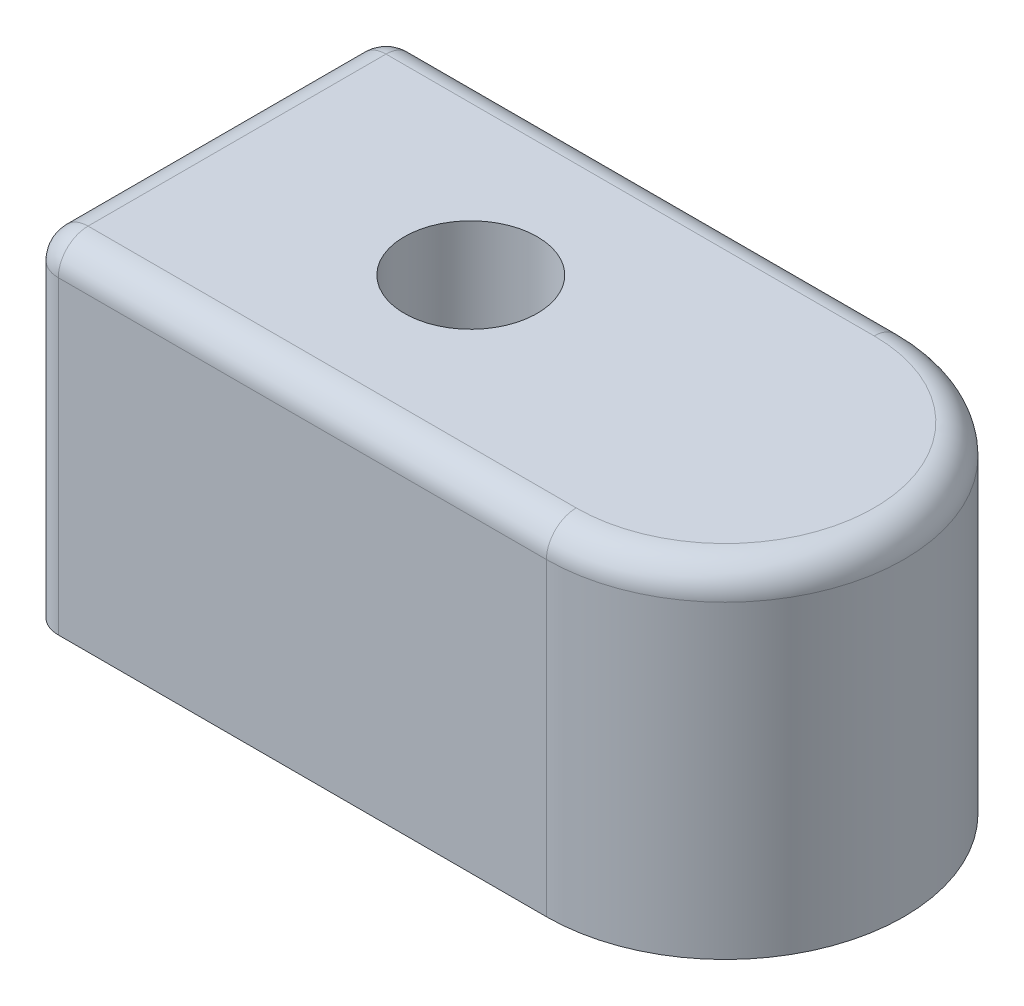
ISO-10303-21;
HEADER;
FILE_DESCRIPTION(('STEP AP214'),'2;1');
FILE_NAME('part.step','',(''),(''),'','','');
FILE_SCHEMA(('AUTOMOTIVE_DESIGN { 1 0 10303 214 1 1 1 1 }'));
ENDSEC;
DATA;
#1=APPLICATION_CONTEXT('core data for automotive mechanical design processes');
#2=APPLICATION_PROTOCOL_DEFINITION('international standard','automotive_design',2000,#1);
#3=PRODUCT_CONTEXT('',#1,'mechanical');
#4=PRODUCT('Part','Part','',(#3));
#5=PRODUCT_RELATED_PRODUCT_CATEGORY('part','',(#4));
#6=PRODUCT_DEFINITION_FORMATION('','',#4);
#7=PRODUCT_DEFINITION_CONTEXT('part definition',#1,'design');
#8=PRODUCT_DEFINITION('design','',#6,#7);
#9=PRODUCT_DEFINITION_SHAPE('','',#8);
#10=(LENGTH_UNIT() NAMED_UNIT(*) SI_UNIT(.MILLI.,.METRE.));
#11=(NAMED_UNIT(*) PLANE_ANGLE_UNIT() SI_UNIT($,.RADIAN.));
#12=(NAMED_UNIT(*) SI_UNIT($,.STERADIAN.) SOLID_ANGLE_UNIT());
#13=UNCERTAINTY_MEASURE_WITH_UNIT(LENGTH_MEASURE(1.E-05),#10,'distance_accuracy_value','');
#14=(GEOMETRIC_REPRESENTATION_CONTEXT(3) GLOBAL_UNCERTAINTY_ASSIGNED_CONTEXT((#13)) GLOBAL_UNIT_ASSIGNED_CONTEXT((#10,
#11,#12)) REPRESENTATION_CONTEXT('',''));
#15=CARTESIAN_POINT('',(0.,0.,0.));
#16=DIRECTION('',(0.,0.,1.));
#17=DIRECTION('',(1.,0.,0.));
#18=AXIS2_PLACEMENT_3D('',#15,#16,#17);
#19=CARTESIAN_POINT('',(0.,37.592,-19.8120000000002));
#20=DIRECTION('',(0.,0.,1.00000000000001));
#21=DIRECTION('',(1.00000000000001,0.,0.));
#22=AXIS2_PLACEMENT_3D('',#19,#20,#21);
#23=PLANE('',#22);
#24=DIRECTION('',(-1.00000000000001,0.,0.));
#25=VECTOR('',#24,1.);
#26=CARTESIAN_POINT('',(-1.11022302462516E-13,0.,-19.8120000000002));
#27=LINE('',#26,#25);
#28=CARTESIAN_POINT('',(28.194,0.,-19.8120000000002));
#29=VERTEX_POINT('',#28);
#30=CARTESIAN_POINT('',(-25.9080000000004,0.,-19.8120000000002));
#31=VERTEX_POINT('',#30);
#32=EDGE_CURVE('E118',#29,#31,#27,.T.);
#33=ORIENTED_EDGE('',*,*,#32,.T.);
#34=DIRECTION('',(0.,-1.,0.));
#35=VECTOR('',#34,1.);
#36=CARTESIAN_POINT('',(-25.9080000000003,37.592,-19.8120000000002));
#37=LINE('',#36,#35);
#38=CARTESIAN_POINT('',(-25.9080000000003,34.29,-19.8120000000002));
#39=VERTEX_POINT('',#38);
#40=EDGE_CURVE('E11',#31,#39,#37,.F.);
#41=ORIENTED_EDGE('',*,*,#40,.T.);
#42=DIRECTION('',(-1.00000000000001,0.,0.));
#43=VECTOR('',#42,1.);
#44=CARTESIAN_POINT('',(28.1940000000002,34.29,-19.8120000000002));
#45=LINE('',#44,#43);
#46=CARTESIAN_POINT('',(28.1940000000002,34.29,-19.8120000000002));
#47=VERTEX_POINT('',#46);
#48=EDGE_CURVE('E138',#39,#47,#45,.F.);
#49=ORIENTED_EDGE('',*,*,#48,.T.);
#50=DIRECTION('',(0.,-1.,0.));
#51=VECTOR('',#50,1.);
#52=CARTESIAN_POINT('',(28.1940000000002,37.592,-19.8120000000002));
#53=LINE('',#52,#51);
#54=EDGE_CURVE('E113',#47,#29,#53,.T.);
#55=ORIENTED_EDGE('',*,*,#54,.T.);
#56=EDGE_LOOP('',(#33,#41,#49,#55));
#57=FACE_BOUND('',#56,.T.);
#58=ADVANCED_FACE('F30',(#57),#23,.F.);
#59=CARTESIAN_POINT('',(-29.2100000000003,37.592,-19.8120000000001));
#60=DIRECTION('',(1.00000000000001,0.,0.));
#61=DIRECTION('',(0.,0.,-1.00000000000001));
#62=AXIS2_PLACEMENT_3D('',#59,#60,#61);
#63=PLANE('',#62);
#64=DIRECTION('',(0.,0.,1.00000000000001));
#65=VECTOR('',#64,1.);
#66=CARTESIAN_POINT('',(-29.2100000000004,0.,-19.8120000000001));
#67=LINE('',#66,#65);
#68=CARTESIAN_POINT('',(-29.2100000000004,0.,-16.5100000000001));
#69=VERTEX_POINT('',#68);
#70=CARTESIAN_POINT('',(-29.2100000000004,0.,16.5100000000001));
#71=VERTEX_POINT('',#70);
#72=EDGE_CURVE('E103',#69,#71,#67,.T.);
#73=ORIENTED_EDGE('',*,*,#72,.T.);
#74=DIRECTION('',(0.,-1.,0.));
#75=VECTOR('',#74,1.);
#76=CARTESIAN_POINT('',(-29.2100000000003,37.592,16.5100000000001));
#77=LINE('',#76,#75);
#78=CARTESIAN_POINT('',(-29.2100000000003,34.29,16.5100000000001));
#79=VERTEX_POINT('',#78);
#80=EDGE_CURVE('E37',#71,#79,#77,.F.);
#81=ORIENTED_EDGE('',*,*,#80,.T.);
#82=DIRECTION('',(0.,0.,1.00000000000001));
#83=VECTOR('',#82,1.);
#84=CARTESIAN_POINT('',(-29.2100000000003,34.29,-19.8120000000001));
#85=LINE('',#84,#83);
#86=CARTESIAN_POINT('',(-29.2100000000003,34.29,-16.5100000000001));
#87=VERTEX_POINT('',#86);
#88=EDGE_CURVE('E136',#79,#87,#85,.F.);
#89=ORIENTED_EDGE('',*,*,#88,.T.);
#90=DIRECTION('',(0.,-1.,0.));
#91=VECTOR('',#90,1.);
#92=CARTESIAN_POINT('',(-29.2100000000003,37.592,-16.5100000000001));
#93=LINE('',#92,#91);
#94=EDGE_CURVE('E51',#87,#69,#93,.T.);
#95=ORIENTED_EDGE('',*,*,#94,.T.);
#96=EDGE_LOOP('',(#73,#81,#89,#95));
#97=FACE_BOUND('',#96,.T.);
#98=ADVANCED_FACE('F156',(#97),#63,.F.);
#99=CARTESIAN_POINT('',(28.1940000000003,37.592,19.8120000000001));
#100=DIRECTION('',(0.,0.,-1.00000000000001));
#101=DIRECTION('',(-1.00000000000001,0.,0.));
#102=AXIS2_PLACEMENT_3D('',#99,#100,#101);
#103=PLANE('',#102);
#104=DIRECTION('',(1.00000000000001,0.,0.));
#105=VECTOR('',#104,1.);
#106=CARTESIAN_POINT('',(-29.2100000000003,34.29,19.8120000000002));
#107=LINE('',#106,#105);
#108=CARTESIAN_POINT('',(28.1940000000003,34.2900000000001,19.8120000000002));
#109=VERTEX_POINT('',#108);
#110=CARTESIAN_POINT('',(-25.9080000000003,34.29,19.8120000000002));
#111=VERTEX_POINT('',#110);
#112=EDGE_CURVE('E134',#109,#111,#107,.F.);
#113=ORIENTED_EDGE('',*,*,#112,.T.);
#114=DIRECTION('',(0.,-1.,0.));
#115=VECTOR('',#114,1.);
#116=CARTESIAN_POINT('',(-25.9080000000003,37.592,19.8120000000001));
#117=LINE('',#116,#115);
#118=CARTESIAN_POINT('',(-25.9080000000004,0.,19.8120000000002));
#119=VERTEX_POINT('',#118);
#120=EDGE_CURVE('E100',#111,#119,#117,.T.);
#121=ORIENTED_EDGE('',*,*,#120,.T.);
#122=DIRECTION('',(1.00000000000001,0.,0.));
#123=VECTOR('',#122,1.);
#124=CARTESIAN_POINT('',(28.1940000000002,0.,19.8120000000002));
#125=LINE('',#124,#123);
#126=CARTESIAN_POINT('',(28.1940000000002,0.,19.8120000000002));
#127=VERTEX_POINT('',#126);
#128=EDGE_CURVE('E94',#119,#127,#125,.T.);
#129=ORIENTED_EDGE('',*,*,#128,.T.);
#130=DIRECTION('',(0.,-1.,0.));
#131=VECTOR('',#130,1.);
#132=CARTESIAN_POINT('',(28.1940000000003,37.592,19.8120000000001));
#133=LINE('',#132,#131);
#134=EDGE_CURVE('E98',#109,#127,#133,.T.);
#135=ORIENTED_EDGE('',*,*,#134,.F.);
#136=EDGE_LOOP('',(#113,#121,#129,#135));
#137=FACE_BOUND('',#136,.T.);
#138=ADVANCED_FACE('F97',(#137),#103,.F.);
#139=CARTESIAN_POINT('',(28.194,37.592,0.));
#140=DIRECTION('',(0.,-1.,0.));
#141=DIRECTION('',(0.,0.,-1.00000000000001));
#142=AXIS2_PLACEMENT_3D('',#139,#140,#141);
#143=CYLINDRICAL_SURFACE('',#142,19.812);
#144=ORIENTED_EDGE('',*,*,#54,.F.);
#145=CARTESIAN_POINT('',(28.194,34.29,0.));
#146=DIRECTION('',(0.,1.,0.));
#147=DIRECTION('',(0.,0.,1.00000000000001));
#148=AXIS2_PLACEMENT_3D('',#145,#146,#147);
#149=CIRCLE('',#148,19.812);
#150=EDGE_CURVE('E111',#47,#109,#149,.F.);
#151=ORIENTED_EDGE('',*,*,#150,.T.);
#152=ORIENTED_EDGE('',*,*,#134,.T.);
#153=CARTESIAN_POINT('',(28.194,0.,0.));
#154=DIRECTION('',(0.,1.,0.));
#155=DIRECTION('',(0.,0.,1.00000000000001));
#156=AXIS2_PLACEMENT_3D('',#153,#154,#155);
#157=CIRCLE('',#156,19.812);
#158=EDGE_CURVE('E102',#127,#29,#157,.T.);
#159=ORIENTED_EDGE('',*,*,#158,.T.);
#160=EDGE_LOOP('',(#144,#151,#152,#159));
#161=FACE_BOUND('',#160,.T.);
#162=ADVANCED_FACE('F109',(#161),#143,.T.);
#163=CARTESIAN_POINT('',(28.194,37.592,0.));
#164=DIRECTION('',(0.,1.,0.));
#165=DIRECTION('',(0.,0.,1.00000000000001));
#166=AXIS2_PLACEMENT_3D('',#163,#164,#165);
#167=PLANE('',#166);
#168=DIRECTION('',(1.00000000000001,0.,0.));
#169=VECTOR('',#168,1.);
#170=CARTESIAN_POINT('',(28.1940000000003,37.592,16.5100000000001));
#171=LINE('',#170,#169);
#172=CARTESIAN_POINT('',(-25.9080000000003,37.592,16.5100000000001));
#173=VERTEX_POINT('',#172);
#174=CARTESIAN_POINT('',(28.1940000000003,37.592,16.5100000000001));
#175=VERTEX_POINT('',#174);
#176=EDGE_CURVE('E128',#173,#175,#171,.T.);
#177=ORIENTED_EDGE('',*,*,#176,.T.);
#178=CARTESIAN_POINT('',(28.194,37.592,0.));
#179=DIRECTION('',(0.,1.,0.));
#180=DIRECTION('',(0.,0.,1.00000000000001));
#181=AXIS2_PLACEMENT_3D('',#178,#179,#180);
#182=CIRCLE('',#181,16.51);
#183=CARTESIAN_POINT('',(28.1940000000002,37.592,-16.5100000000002));
#184=VERTEX_POINT('',#183);
#185=EDGE_CURVE('E130',#175,#184,#182,.T.);
#186=ORIENTED_EDGE('',*,*,#185,.T.);
#187=DIRECTION('',(-1.00000000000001,0.,0.));
#188=VECTOR('',#187,1.);
#189=CARTESIAN_POINT('',(-29.2100000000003,37.592,-16.5100000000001));
#190=LINE('',#189,#188);
#191=CARTESIAN_POINT('',(-25.9080000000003,37.592,-16.5100000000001));
#192=VERTEX_POINT('',#191);
#193=EDGE_CURVE('E112',#184,#192,#190,.T.);
#194=ORIENTED_EDGE('',*,*,#193,.T.);
#195=DIRECTION('',(0.,0.,1.00000000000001));
#196=VECTOR('',#195,1.);
#197=CARTESIAN_POINT('',(-25.9080000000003,37.592,19.8120000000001));
#198=LINE('',#197,#196);
#199=EDGE_CURVE('E125',#192,#173,#198,.T.);
#200=ORIENTED_EDGE('',*,*,#199,.T.);
#201=EDGE_LOOP('',(#177,#186,#194,#200));
#202=FACE_BOUND('',#201,.T.);
#203=CARTESIAN_POINT('',(0.,37.592,0.));
#204=DIRECTION('',(0.,-1.,0.));
#205=DIRECTION('',(0.,0.,-1.00000000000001));
#206=AXIS2_PLACEMENT_3D('',#203,#204,#205);
#207=CIRCLE('',#206,7.366);
#208=CARTESIAN_POINT('',(0.,37.592,-7.36600000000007));
#209=VERTEX_POINT('',#208);
#210=EDGE_CURVE('E180',#209,#209,#207,.T.);
#211=ORIENTED_EDGE('',*,*,#210,.T.);
#212=EDGE_LOOP('',(#211));
#213=FACE_BOUND('',#212,.T.);
#214=ADVANCED_FACE('F198',(#202,#213),#167,.T.);
#215=CARTESIAN_POINT('',(28.194,0.,0.));
#216=DIRECTION('',(0.,1.,0.));
#217=DIRECTION('',(0.,0.,1.00000000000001));
#218=AXIS2_PLACEMENT_3D('',#215,#216,#217);
#219=PLANE('',#218);
#220=CARTESIAN_POINT('',(0.,0.,0.));
#221=DIRECTION('',(0.,-1.,0.));
#222=DIRECTION('',(0.,0.,-1.00000000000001));
#223=AXIS2_PLACEMENT_3D('',#220,#221,#222);
#224=CIRCLE('',#223,7.366);
#225=CARTESIAN_POINT('',(0.,0.,-7.3660000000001));
#226=VERTEX_POINT('',#225);
#227=EDGE_CURVE('E177',#226,#226,#224,.T.);
#228=ORIENTED_EDGE('',*,*,#227,.F.);
#229=EDGE_LOOP('',(#228));
#230=FACE_BOUND('',#229,.T.);
#231=ORIENTED_EDGE('',*,*,#128,.F.);
#232=CARTESIAN_POINT('',(-25.9080000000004,0.,16.5100000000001));
#233=DIRECTION('',(0.,1.,0.));
#234=DIRECTION('',(0.,0.,1.00000000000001));
#235=AXIS2_PLACEMENT_3D('',#232,#233,#234);
#236=CIRCLE('',#235,3.302);
#237=EDGE_CURVE('E44',#119,#71,#236,.F.);
#238=ORIENTED_EDGE('',*,*,#237,.T.);
#239=ORIENTED_EDGE('',*,*,#72,.F.);
#240=CARTESIAN_POINT('',(-25.9080000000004,0.,-16.5100000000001));
#241=DIRECTION('',(0.,1.,0.));
#242=DIRECTION('',(0.,0.,1.00000000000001));
#243=AXIS2_PLACEMENT_3D('',#240,#241,#242);
#244=CIRCLE('',#243,3.302);
#245=EDGE_CURVE('E151',#69,#31,#244,.F.);
#246=ORIENTED_EDGE('',*,*,#245,.T.);
#247=ORIENTED_EDGE('',*,*,#32,.F.);
#248=ORIENTED_EDGE('',*,*,#158,.F.);
#249=EDGE_LOOP('',(#231,#238,#239,#246,#247,#248));
#250=FACE_BOUND('',#249,.T.);
#251=ADVANCED_FACE('F116',(#230,#250),#219,.F.);
#252=CARTESIAN_POINT('',(0.,37.592,0.));
#253=DIRECTION('',(0.,-1.,0.));
#254=DIRECTION('',(0.,0.,-1.00000000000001));
#255=AXIS2_PLACEMENT_3D('',#252,#253,#254);
#256=CYLINDRICAL_SURFACE('',#255,7.366);
#257=ORIENTED_EDGE('',*,*,#210,.F.);
#258=EDGE_LOOP('',(#257));
#259=FACE_BOUND('',#258,.T.);
#260=ORIENTED_EDGE('',*,*,#227,.T.);
#261=EDGE_LOOP('',(#260));
#262=FACE_BOUND('',#261,.T.);
#263=ADVANCED_FACE('F215',(#259,#262),#256,.F.);
#264=CARTESIAN_POINT('',(-25.9080000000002,34.29,0.));
#265=DIRECTION('',(0.,0.,-1.00000000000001));
#266=DIRECTION('',(-1.00000000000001,0.,0.));
#267=AXIS2_PLACEMENT_3D('',#264,#265,#266);
#268=CYLINDRICAL_SURFACE('',#267,3.302);
#269=ORIENTED_EDGE('',*,*,#88,.F.);
#270=CARTESIAN_POINT('',(-25.9080000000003,34.29,16.5100000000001));
#271=DIRECTION('',(0.,0.,-1.00000000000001));
#272=DIRECTION('',(-1.00000000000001,0.,0.));
#273=AXIS2_PLACEMENT_3D('',#270,#271,#272);
#274=CIRCLE('',#273,3.302);
#275=EDGE_CURVE('E145',#79,#173,#274,.T.);
#276=ORIENTED_EDGE('',*,*,#275,.T.);
#277=ORIENTED_EDGE('',*,*,#199,.F.);
#278=CARTESIAN_POINT('',(-25.9080000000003,34.29,-16.5100000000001));
#279=DIRECTION('',(0.,0.,-1.00000000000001));
#280=DIRECTION('',(-1.00000000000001,0.,0.));
#281=AXIS2_PLACEMENT_3D('',#278,#279,#280);
#282=CIRCLE('',#281,3.302);
#283=EDGE_CURVE('E143',#192,#87,#282,.F.);
#284=ORIENTED_EDGE('',*,*,#283,.T.);
#285=EDGE_LOOP('',(#269,#276,#277,#284));
#286=FACE_BOUND('',#285,.T.);
#287=ADVANCED_FACE('F161',(#286),#268,.T.);
#288=CARTESIAN_POINT('',(28.1940000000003,34.29,16.5100000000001));
#289=DIRECTION('',(-1.00000000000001,0.,0.));
#290=DIRECTION('',(0.,0.,1.00000000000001));
#291=AXIS2_PLACEMENT_3D('',#288,#289,#290);
#292=CYLINDRICAL_SURFACE('',#291,3.302);
#293=ORIENTED_EDGE('',*,*,#176,.F.);
#294=CARTESIAN_POINT('',(-25.9080000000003,34.29,16.5100000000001));
#295=DIRECTION('',(-1.00000000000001,0.,0.));
#296=DIRECTION('',(0.,0.,1.00000000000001));
#297=AXIS2_PLACEMENT_3D('',#294,#295,#296);
#298=CIRCLE('',#297,3.302);
#299=EDGE_CURVE('E140',#173,#111,#298,.F.);
#300=ORIENTED_EDGE('',*,*,#299,.T.);
#301=ORIENTED_EDGE('',*,*,#112,.F.);
#302=CARTESIAN_POINT('',(28.1940000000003,34.29,16.5100000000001));
#303=DIRECTION('',(1.00000000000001,0.,0.));
#304=DIRECTION('',(0.,0.,-1.00000000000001));
#305=AXIS2_PLACEMENT_3D('',#302,#303,#304);
#306=CIRCLE('',#305,3.302);
#307=EDGE_CURVE('E171',#175,#109,#306,.T.);
#308=ORIENTED_EDGE('',*,*,#307,.F.);
#309=EDGE_LOOP('',(#293,#300,#301,#308));
#310=FACE_BOUND('',#309,.T.);
#311=ADVANCED_FACE('F207',(#310),#292,.T.);
#312=CARTESIAN_POINT('',(28.1940000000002,34.2900000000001,-16.5100000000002));
#313=DIRECTION('',(1.00000000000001,0.,0.));
#314=DIRECTION('',(0.,0.,-1.00000000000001));
#315=AXIS2_PLACEMENT_3D('',#312,#313,#314);
#316=CYLINDRICAL_SURFACE('',#315,3.302);
#317=ORIENTED_EDGE('',*,*,#48,.F.);
#318=CARTESIAN_POINT('',(-25.9080000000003,34.29,-16.5100000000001));
#319=DIRECTION('',(1.00000000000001,0.,0.));
#320=DIRECTION('',(0.,0.,-1.00000000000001));
#321=AXIS2_PLACEMENT_3D('',#318,#319,#320);
#322=CIRCLE('',#321,3.302);
#323=EDGE_CURVE('E147',#39,#192,#322,.T.);
#324=ORIENTED_EDGE('',*,*,#323,.T.);
#325=ORIENTED_EDGE('',*,*,#193,.F.);
#326=CARTESIAN_POINT('',(28.1940000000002,34.2900000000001,-16.5100000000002));
#327=DIRECTION('',(1.00000000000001,0.,0.));
#328=DIRECTION('',(0.,0.,-1.00000000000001));
#329=AXIS2_PLACEMENT_3D('',#326,#327,#328);
#330=CIRCLE('',#329,3.302);
#331=EDGE_CURVE('E168',#47,#184,#330,.T.);
#332=ORIENTED_EDGE('',*,*,#331,.F.);
#333=EDGE_LOOP('',(#317,#324,#325,#332));
#334=FACE_BOUND('',#333,.T.);
#335=ADVANCED_FACE('F195',(#334),#316,.T.);
#336=CARTESIAN_POINT('',(28.194,34.29,0.));
#337=DIRECTION('',(0.,1.,0.));
#338=DIRECTION('',(0.,0.,1.00000000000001));
#339=AXIS2_PLACEMENT_3D('',#336,#337,#338);
#340=TOROIDAL_SURFACE('',#339,16.51,3.302);
#341=ORIENTED_EDGE('',*,*,#307,.T.);
#342=ORIENTED_EDGE('',*,*,#150,.F.);
#343=ORIENTED_EDGE('',*,*,#331,.T.);
#344=ORIENTED_EDGE('',*,*,#185,.F.);
#345=EDGE_LOOP('',(#341,#342,#343,#344));
#346=FACE_BOUND('',#345,.T.);
#347=ADVANCED_FACE('F204',(#346),#340,.T.);
#348=CARTESIAN_POINT('',(-25.9080000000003,37.592,16.5100000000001));
#349=DIRECTION('',(0.,-1.,0.));
#350=DIRECTION('',(0.,0.,-1.00000000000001));
#351=AXIS2_PLACEMENT_3D('',#348,#349,#350);
#352=CYLINDRICAL_SURFACE('',#351,3.302);
#353=ORIENTED_EDGE('',*,*,#237,.F.);
#354=ORIENTED_EDGE('',*,*,#120,.F.);
#355=CARTESIAN_POINT('',(-25.9080000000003,34.29,16.5100000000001));
#356=DIRECTION('',(0.,1.,0.));
#357=DIRECTION('',(0.,0.,1.00000000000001));
#358=AXIS2_PLACEMENT_3D('',#355,#356,#357);
#359=CIRCLE('',#358,3.302);
#360=EDGE_CURVE('E166',#79,#111,#359,.T.);
#361=ORIENTED_EDGE('',*,*,#360,.F.);
#362=ORIENTED_EDGE('',*,*,#80,.F.);
#363=EDGE_LOOP('',(#353,#354,#361,#362));
#364=FACE_BOUND('',#363,.T.);
#365=ADVANCED_FACE('F167',(#364),#352,.T.);
#366=CARTESIAN_POINT('',(-25.9080000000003,34.29,16.5100000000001));
#367=DIRECTION('',(0.,0.,1.00000000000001));
#368=DIRECTION('',(1.00000000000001,0.,0.));
#369=AXIS2_PLACEMENT_3D('',#366,#367,#368);
#370=SPHERICAL_SURFACE('',#369,3.302);
#371=ORIENTED_EDGE('',*,*,#299,.F.);
#372=ORIENTED_EDGE('',*,*,#275,.F.);
#373=ORIENTED_EDGE('',*,*,#360,.T.);
#374=EDGE_LOOP('',(#371,#372,#373));
#375=FACE_BOUND('',#374,.T.);
#376=ADVANCED_FACE('F165',(#375),#370,.T.);
#377=CARTESIAN_POINT('',(-25.9080000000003,37.592,-16.5100000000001));
#378=DIRECTION('',(0.,-1.,0.));
#379=DIRECTION('',(0.,0.,-1.00000000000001));
#380=AXIS2_PLACEMENT_3D('',#377,#378,#379);
#381=CYLINDRICAL_SURFACE('',#380,3.302);
#382=ORIENTED_EDGE('',*,*,#245,.F.);
#383=ORIENTED_EDGE('',*,*,#94,.F.);
#384=CARTESIAN_POINT('',(-25.9080000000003,34.29,-16.5100000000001));
#385=DIRECTION('',(0.,1.,0.));
#386=DIRECTION('',(0.,0.,1.00000000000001));
#387=AXIS2_PLACEMENT_3D('',#384,#385,#386);
#388=CIRCLE('',#387,3.302);
#389=EDGE_CURVE('E169',#39,#87,#388,.T.);
#390=ORIENTED_EDGE('',*,*,#389,.F.);
#391=ORIENTED_EDGE('',*,*,#40,.F.);
#392=EDGE_LOOP('',(#382,#383,#390,#391));
#393=FACE_BOUND('',#392,.T.);
#394=ADVANCED_FACE('F189',(#393),#381,.T.);
#395=CARTESIAN_POINT('',(-25.9080000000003,34.29,-16.5100000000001));
#396=DIRECTION('',(0.,0.,1.00000000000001));
#397=DIRECTION('',(1.00000000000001,0.,0.));
#398=AXIS2_PLACEMENT_3D('',#395,#396,#397);
#399=SPHERICAL_SURFACE('',#398,3.302);
#400=ORIENTED_EDGE('',*,*,#389,.T.);
#401=ORIENTED_EDGE('',*,*,#283,.F.);
#402=ORIENTED_EDGE('',*,*,#323,.F.);
#403=EDGE_LOOP('',(#400,#401,#402));
#404=FACE_BOUND('',#403,.T.);
#405=ADVANCED_FACE('F192',(#404),#399,.T.);
#406=CLOSED_SHELL('',(#58,#98,#138,#162,#214,#251,#263,#287,#311,#335,#347,#365,#376,#394,#405));
#407=MANIFOLD_SOLID_BREP('B2',#406);
#408=ADVANCED_BREP_SHAPE_REPRESENTATION('',(#18,#407),#14);
#409=SHAPE_DEFINITION_REPRESENTATION(#9,#408);
ENDSEC;
END-ISO-10303-21;
